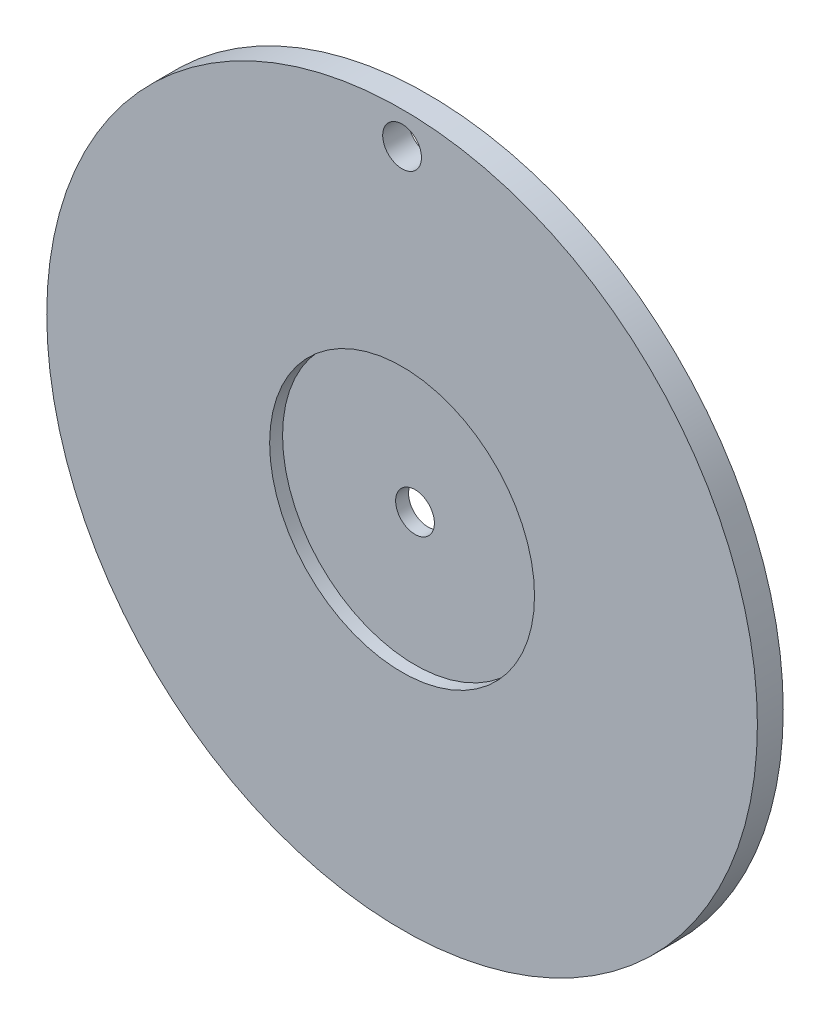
ISO-10303-21;
HEADER;
FILE_DESCRIPTION(('STEP AP214'),'2;1');
FILE_NAME('part.step','',(''),(''),'','','');
FILE_SCHEMA(('AUTOMOTIVE_DESIGN { 1 0 10303 214 1 1 1 1 }'));
ENDSEC;
DATA;
#1=APPLICATION_CONTEXT('core data for automotive mechanical design processes');
#2=APPLICATION_PROTOCOL_DEFINITION('international standard','automotive_design',2000,#1);
#3=PRODUCT_CONTEXT('',#1,'mechanical');
#4=PRODUCT('Part','Part','',(#3));
#5=PRODUCT_RELATED_PRODUCT_CATEGORY('part','',(#4));
#6=PRODUCT_DEFINITION_FORMATION('','',#4);
#7=PRODUCT_DEFINITION_CONTEXT('part definition',#1,'design');
#8=PRODUCT_DEFINITION('design','',#6,#7);
#9=PRODUCT_DEFINITION_SHAPE('','',#8);
#10=(LENGTH_UNIT() NAMED_UNIT(*) SI_UNIT(.MILLI.,.METRE.));
#11=(NAMED_UNIT(*) PLANE_ANGLE_UNIT() SI_UNIT($,.RADIAN.));
#12=(NAMED_UNIT(*) SI_UNIT($,.STERADIAN.) SOLID_ANGLE_UNIT());
#13=UNCERTAINTY_MEASURE_WITH_UNIT(LENGTH_MEASURE(1.E-05),#10,'distance_accuracy_value','');
#14=(GEOMETRIC_REPRESENTATION_CONTEXT(3) GLOBAL_UNCERTAINTY_ASSIGNED_CONTEXT((#13)) GLOBAL_UNIT_ASSIGNED_CONTEXT((#10,
#11,#12)) REPRESENTATION_CONTEXT('',''));
#15=CARTESIAN_POINT('',(0.,0.,0.));
#16=DIRECTION('',(0.,0.,1.));
#17=DIRECTION('',(1.,0.,0.));
#18=AXIS2_PLACEMENT_3D('',#15,#16,#17);
#19=CARTESIAN_POINT('',(0.,0.,2.));
#20=DIRECTION('',(0.,0.,1.));
#21=DIRECTION('',(1.,0.,0.));
#22=AXIS2_PLACEMENT_3D('',#19,#20,#21);
#23=PLANE('',#22);
#24=CARTESIAN_POINT('',(0.,0.,2.));
#25=DIRECTION('',(0.,0.,1.));
#26=DIRECTION('',(1.,0.,0.));
#27=AXIS2_PLACEMENT_3D('',#24,#25,#26);
#28=CIRCLE('',#27,10.25);
#29=CARTESIAN_POINT('',(10.25,0.,2.));
#30=VERTEX_POINT('',#29);
#31=EDGE_CURVE('E64',#30,#30,#28,.T.);
#32=ORIENTED_EDGE('',*,*,#31,.F.);
#33=EDGE_LOOP('',(#32));
#34=FACE_BOUND('',#33,.T.);
#35=CARTESIAN_POINT('',(0.,0.,2.));
#36=DIRECTION('',(0.,0.,1.));
#37=DIRECTION('',(1.,0.,0.));
#38=AXIS2_PLACEMENT_3D('',#35,#36,#37);
#39=CIRCLE('',#38,27.5);
#40=CARTESIAN_POINT('',(27.5,0.,2.));
#41=VERTEX_POINT('',#40);
#42=EDGE_CURVE('E11',#41,#41,#39,.T.);
#43=ORIENTED_EDGE('',*,*,#42,.T.);
#44=EDGE_LOOP('',(#43));
#45=FACE_BOUND('',#44,.T.);
#46=CARTESIAN_POINT('',(0.,25.,2.));
#47=DIRECTION('',(0.,0.,1.));
#48=DIRECTION('',(1.,0.,0.));
#49=AXIS2_PLACEMENT_3D('',#46,#47,#48);
#50=CIRCLE('',#49,1.5);
#51=CARTESIAN_POINT('',(1.5,25.,2.));
#52=VERTEX_POINT('',#51);
#53=EDGE_CURVE('E56',#52,#52,#50,.T.);
#54=ORIENTED_EDGE('',*,*,#53,.F.);
#55=EDGE_LOOP('',(#54));
#56=FACE_BOUND('',#55,.T.);
#57=ADVANCED_FACE('F45',(#34,#45,#56),#23,.T.);
#58=CARTESIAN_POINT('',(0.,0.,0.));
#59=DIRECTION('',(0.,0.,1.));
#60=DIRECTION('',(1.,0.,0.));
#61=AXIS2_PLACEMENT_3D('',#58,#59,#60);
#62=PLANE('',#61);
#63=CARTESIAN_POINT('',(0.,0.,0.));
#64=DIRECTION('',(0.,0.,1.));
#65=DIRECTION('',(1.,0.,0.));
#66=AXIS2_PLACEMENT_3D('',#63,#64,#65);
#67=CIRCLE('',#66,1.5);
#68=CARTESIAN_POINT('',(1.5,0.,0.));
#69=VERTEX_POINT('',#68);
#70=EDGE_CURVE('E67',#69,#69,#67,.T.);
#71=ORIENTED_EDGE('',*,*,#70,.T.);
#72=EDGE_LOOP('',(#71));
#73=FACE_BOUND('',#72,.T.);
#74=CARTESIAN_POINT('',(0.,0.,0.));
#75=DIRECTION('',(0.,0.,1.));
#76=DIRECTION('',(1.,0.,0.));
#77=AXIS2_PLACEMENT_3D('',#74,#75,#76);
#78=CIRCLE('',#77,27.5);
#79=CARTESIAN_POINT('',(27.5,0.,0.));
#80=VERTEX_POINT('',#79);
#81=EDGE_CURVE('E49',#80,#80,#78,.T.);
#82=ORIENTED_EDGE('',*,*,#81,.F.);
#83=EDGE_LOOP('',(#82));
#84=FACE_BOUND('',#83,.T.);
#85=CARTESIAN_POINT('',(0.,25.,0.));
#86=DIRECTION('',(0.,0.,1.));
#87=DIRECTION('',(1.,0.,0.));
#88=AXIS2_PLACEMENT_3D('',#85,#86,#87);
#89=CIRCLE('',#88,1.5);
#90=CARTESIAN_POINT('',(1.5,25.,0.));
#91=VERTEX_POINT('',#90);
#92=EDGE_CURVE('E58',#91,#91,#89,.T.);
#93=ORIENTED_EDGE('',*,*,#92,.T.);
#94=EDGE_LOOP('',(#93));
#95=FACE_BOUND('',#94,.T.);
#96=ADVANCED_FACE('F93',(#73,#84,#95),#62,.F.);
#97=CARTESIAN_POINT('',(0.,0.,2.));
#98=DIRECTION('',(0.,0.,-1.));
#99=DIRECTION('',(-1.,0.,0.));
#100=AXIS2_PLACEMENT_3D('',#97,#98,#99);
#101=CYLINDRICAL_SURFACE('',#100,27.5);
#102=ORIENTED_EDGE('',*,*,#42,.F.);
#103=EDGE_LOOP('',(#102));
#104=FACE_BOUND('',#103,.T.);
#105=ORIENTED_EDGE('',*,*,#81,.T.);
#106=EDGE_LOOP('',(#105));
#107=FACE_BOUND('',#106,.T.);
#108=ADVANCED_FACE('F47',(#104,#107),#101,.T.);
#109=CARTESIAN_POINT('',(0.,25.,2.));
#110=DIRECTION('',(0.,0.,-1.));
#111=DIRECTION('',(-1.,0.,0.));
#112=AXIS2_PLACEMENT_3D('',#109,#110,#111);
#113=CYLINDRICAL_SURFACE('',#112,1.5);
#114=ORIENTED_EDGE('',*,*,#53,.T.);
#115=EDGE_LOOP('',(#114));
#116=FACE_BOUND('',#115,.T.);
#117=ORIENTED_EDGE('',*,*,#92,.F.);
#118=EDGE_LOOP('',(#117));
#119=FACE_BOUND('',#118,.T.);
#120=ADVANCED_FACE('F88',(#116,#119),#113,.F.);
#121=CARTESIAN_POINT('',(0.,0.,1.));
#122=DIRECTION('',(0.,0.,1.));
#123=DIRECTION('',(1.,0.,0.));
#124=AXIS2_PLACEMENT_3D('',#121,#122,#123);
#125=CYLINDRICAL_SURFACE('',#124,10.25);
#126=CARTESIAN_POINT('',(0.,0.,1.));
#127=DIRECTION('',(0.,0.,1.));
#128=DIRECTION('',(1.,0.,0.));
#129=AXIS2_PLACEMENT_3D('',#126,#127,#128);
#130=CIRCLE('',#129,10.25);
#131=CARTESIAN_POINT('',(10.25,0.,1.));
#132=VERTEX_POINT('',#131);
#133=EDGE_CURVE('E61',#132,#132,#130,.T.);
#134=ORIENTED_EDGE('',*,*,#133,.F.);
#135=EDGE_LOOP('',(#134));
#136=FACE_BOUND('',#135,.T.);
#137=ORIENTED_EDGE('',*,*,#31,.T.);
#138=EDGE_LOOP('',(#137));
#139=FACE_BOUND('',#138,.T.);
#140=ADVANCED_FACE('F82',(#136,#139),#125,.F.);
#141=CARTESIAN_POINT('',(0.,0.,1.));
#142=DIRECTION('',(0.,0.,1.));
#143=DIRECTION('',(1.,0.,0.));
#144=AXIS2_PLACEMENT_3D('',#141,#142,#143);
#145=PLANE('',#144);
#146=CARTESIAN_POINT('',(0.,0.,1.));
#147=DIRECTION('',(0.,0.,1.));
#148=DIRECTION('',(1.,0.,0.));
#149=AXIS2_PLACEMENT_3D('',#146,#147,#148);
#150=CIRCLE('',#149,1.5);
#151=CARTESIAN_POINT('',(1.5,0.,1.));
#152=VERTEX_POINT('',#151);
#153=EDGE_CURVE('E72',#152,#152,#150,.T.);
#154=ORIENTED_EDGE('',*,*,#153,.F.);
#155=EDGE_LOOP('',(#154));
#156=FACE_BOUND('',#155,.T.);
#157=ORIENTED_EDGE('',*,*,#133,.T.);
#158=EDGE_LOOP('',(#157));
#159=FACE_BOUND('',#158,.T.);
#160=ADVANCED_FACE('F79',(#156,#159),#145,.T.);
#161=CARTESIAN_POINT('',(0.,0.,-8.));
#162=DIRECTION('',(0.,0.,1.));
#163=DIRECTION('',(1.,0.,0.));
#164=AXIS2_PLACEMENT_3D('',#161,#162,#163);
#165=CYLINDRICAL_SURFACE('',#164,1.5);
#166=ORIENTED_EDGE('',*,*,#153,.T.);
#167=EDGE_LOOP('',(#166));
#168=FACE_BOUND('',#167,.T.);
#169=ORIENTED_EDGE('',*,*,#70,.F.);
#170=EDGE_LOOP('',(#169));
#171=FACE_BOUND('',#170,.T.);
#172=ADVANCED_FACE('F76',(#168,#171),#165,.F.);
#173=CLOSED_SHELL('',(#57,#96,#108,#120,#140,#160,#172));
#174=MANIFOLD_SOLID_BREP('B2',#173);
#175=ADVANCED_BREP_SHAPE_REPRESENTATION('',(#18,#174),#14);
#176=SHAPE_DEFINITION_REPRESENTATION(#9,#175);
ENDSEC;
END-ISO-10303-21;
